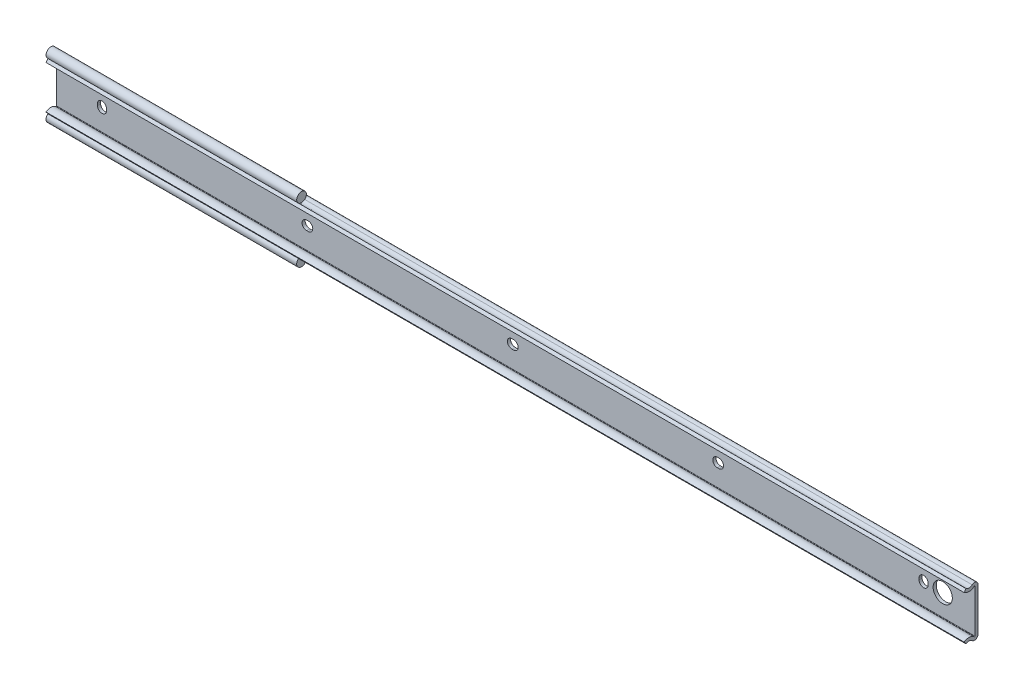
ISO-10303-21;
HEADER;
FILE_DESCRIPTION(('STEP AP214'),'2;1');
FILE_NAME('part.step','',(''),(''),'','','');
FILE_SCHEMA(('AUTOMOTIVE_DESIGN { 1 0 10303 214 1 1 1 1 }'));
ENDSEC;
DATA;
#1=APPLICATION_CONTEXT('core data for automotive mechanical design processes');
#2=APPLICATION_PROTOCOL_DEFINITION('international standard','automotive_design',2000,#1);
#3=PRODUCT_CONTEXT('',#1,'mechanical');
#4=PRODUCT('Part','Part','',(#3));
#5=PRODUCT_RELATED_PRODUCT_CATEGORY('part','',(#4));
#6=PRODUCT_DEFINITION_FORMATION('','',#4);
#7=PRODUCT_DEFINITION_CONTEXT('part definition',#1,'design');
#8=PRODUCT_DEFINITION('design','',#6,#7);
#9=PRODUCT_DEFINITION_SHAPE('','',#8);
#10=(LENGTH_UNIT() NAMED_UNIT(*) SI_UNIT(.MILLI.,.METRE.));
#11=(NAMED_UNIT(*) PLANE_ANGLE_UNIT() SI_UNIT($,.RADIAN.));
#12=(NAMED_UNIT(*) SI_UNIT($,.STERADIAN.) SOLID_ANGLE_UNIT());
#13=UNCERTAINTY_MEASURE_WITH_UNIT(LENGTH_MEASURE(1.E-05),#10,'distance_accuracy_value','');
#14=(GEOMETRIC_REPRESENTATION_CONTEXT(3) GLOBAL_UNCERTAINTY_ASSIGNED_CONTEXT((#13)) GLOBAL_UNIT_ASSIGNED_CONTEXT((#10,
#11,#12)) REPRESENTATION_CONTEXT('',''));
#15=CARTESIAN_POINT('',(0.,0.,0.));
#16=DIRECTION('',(0.,0.,1.));
#17=DIRECTION('',(1.,0.,0.));
#18=AXIS2_PLACEMENT_3D('',#15,#16,#17);
#19=CARTESIAN_POINT('',(431.8,10.6847650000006,1.74000019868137));
#20=DIRECTION('',(-1.,0.,0.));
#21=DIRECTION('',(0.,0.,1.));
#22=AXIS2_PLACEMENT_3D('',#19,#20,#21);
#23=CYLINDRICAL_SURFACE('',#22,1.7400001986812);
#24=CARTESIAN_POINT('',(-22.4,10.6847650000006,1.74000019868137));
#25=DIRECTION('',(1.,0.,0.));
#26=DIRECTION('',(0.,0.,-1.));
#27=AXIS2_PLACEMENT_3D('',#24,#25,#26);
#28=CIRCLE('',#27,1.7400001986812);
#29=CARTESIAN_POINT('',(-22.4,12.421670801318,1.84372545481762));
#30=VERTEX_POINT('',#29);
#31=CARTESIAN_POINT('',(-22.4,12.1726708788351,2.64207380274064));
#32=VERTEX_POINT('',#31);
#33=EDGE_CURVE('E277',#30,#32,#28,.T.);
#34=ORIENTED_EDGE('',*,*,#33,.T.);
#35=DIRECTION('',(-1.,0.,0.));
#36=VECTOR('',#35,1.);
#37=CARTESIAN_POINT('',(39.6,12.1726708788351,2.64207380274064));
#38=LINE('',#37,#36);
#39=CARTESIAN_POINT('',(101.6,12.1726708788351,2.64207380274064));
#40=VERTEX_POINT('',#39);
#41=EDGE_CURVE('E494',#32,#40,#38,.F.);
#42=ORIENTED_EDGE('',*,*,#41,.T.);
#43=CARTESIAN_POINT('',(101.6,10.6847650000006,1.74000019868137));
#44=DIRECTION('',(-1.,0.,0.));
#45=DIRECTION('',(0.,0.,1.));
#46=AXIS2_PLACEMENT_3D('',#43,#44,#45);
#47=CIRCLE('',#46,1.7400001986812);
#48=CARTESIAN_POINT('',(101.6,11.9768810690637,2.90534853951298));
#49=VERTEX_POINT('',#48);
#50=EDGE_CURVE('E490',#49,#40,#47,.T.);
#51=ORIENTED_EDGE('',*,*,#50,.F.);
#52=DIRECTION('',(-1.,0.,0.));
#53=VECTOR('',#52,1.);
#54=CARTESIAN_POINT('',(431.8,11.9768810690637,2.90534853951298));
#55=LINE('',#54,#53);
#56=CARTESIAN_POINT('',(431.8,11.9768810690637,2.90534853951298));
#57=VERTEX_POINT('',#56);
#58=EDGE_CURVE('E367',#57,#49,#55,.T.);
#59=ORIENTED_EDGE('',*,*,#58,.F.);
#60=CARTESIAN_POINT('',(431.8,10.6847650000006,1.74000019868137));
#61=DIRECTION('',(1.,0.,0.));
#62=DIRECTION('',(0.,0.,-1.));
#63=AXIS2_PLACEMENT_3D('',#60,#61,#62);
#64=CIRCLE('',#63,1.7400001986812);
#65=CARTESIAN_POINT('',(431.8,12.421670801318,1.84372545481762));
#66=VERTEX_POINT('',#65);
#67=EDGE_CURVE('E274',#66,#57,#64,.T.);
#68=ORIENTED_EDGE('',*,*,#67,.F.);
#69=CARTESIAN_POINT('',(431.8,10.6847650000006,1.74000019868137));
#70=DIRECTION('',(-1.,0.,0.));
#71=DIRECTION('',(0.,0.998221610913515,0.0596122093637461));
#72=AXIS2_PLACEMENT_3D('',#69,#70,#71);
#73=CIRCLE('',#72,1.7400001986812);
#74=CARTESIAN_POINT('',(431.8,12.421670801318,1.63627494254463));
#75=VERTEX_POINT('',#74);
#76=EDGE_CURVE('E265',#66,#75,#73,.T.);
#77=ORIENTED_EDGE('',*,*,#76,.T.);
#78=CARTESIAN_POINT('',(431.8,10.6847650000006,0.));
#79=VERTEX_POINT('',#78);
#80=EDGE_CURVE('E262',#79,#75,#64,.T.);
#81=ORIENTED_EDGE('',*,*,#80,.F.);
#82=DIRECTION('',(-1.,0.,0.));
#83=VECTOR('',#82,1.);
#84=CARTESIAN_POINT('',(431.8,10.6847650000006,0.));
#85=LINE('',#84,#83);
#86=CARTESIAN_POINT('',(-22.4,10.6847650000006,0.));
#87=VERTEX_POINT('',#86);
#88=EDGE_CURVE('E399',#79,#87,#85,.T.);
#89=ORIENTED_EDGE('',*,*,#88,.T.);
#90=CARTESIAN_POINT('',(-22.4,12.421670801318,1.63627494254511));
#91=VERTEX_POINT('',#90);
#92=EDGE_CURVE('E294',#87,#91,#28,.T.);
#93=ORIENTED_EDGE('',*,*,#92,.T.);
#94=CARTESIAN_POINT('',(-22.4,10.6847650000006,1.74000019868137));
#95=DIRECTION('',(1.,0.,0.));
#96=DIRECTION('',(0.,0.998221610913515,-0.0596122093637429));
#97=AXIS2_PLACEMENT_3D('',#94,#95,#96);
#98=CIRCLE('',#97,1.7400001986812);
#99=EDGE_CURVE('E291',#91,#30,#98,.T.);
#100=ORIENTED_EDGE('',*,*,#99,.T.);
#101=EDGE_LOOP('',(#34,#42,#51,#59,#68,#77,#81,#89,#93,#100));
#102=FACE_BOUND('',#101,.T.);
#103=ADVANCED_FACE('F16',(#102),#23,.T.);
#104=CARTESIAN_POINT('',(431.8,10.6847650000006,1.74000019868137));
#105=DIRECTION('',(1.,0.,0.));
#106=DIRECTION('',(0.,0.,-1.));
#107=AXIS2_PLACEMENT_3D('',#104,#105,#106);
#108=PLANE('',#107);
#109=DIRECTION('',(0.,1.,0.));
#110=VECTOR('',#109,1.);
#111=CARTESIAN_POINT('',(431.8,-10.6847650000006,0.));
#112=LINE('',#111,#110);
#113=CARTESIAN_POINT('',(431.8,-10.6847650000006,0.));
#114=VERTEX_POINT('',#113);
#115=EDGE_CURVE('E269',#114,#79,#112,.T.);
#116=ORIENTED_EDGE('',*,*,#115,.T.);
#117=ORIENTED_EDGE('',*,*,#80,.T.);
#118=ORIENTED_EDGE('',*,*,#76,.F.);
#119=ORIENTED_EDGE('',*,*,#67,.T.);
#120=CARTESIAN_POINT('',(431.8,13.7450000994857,4.50000028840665));
#121=DIRECTION('',(-1.,0.,0.));
#122=DIRECTION('',(0.,0.,-1.));
#123=AXIS2_PLACEMENT_3D('',#120,#121,#122);
#124=CIRCLE('',#123,2.38099960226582);
#125=CARTESIAN_POINT('',(431.8,11.8434490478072,5.93292132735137));
#126=VERTEX_POINT('',#125);
#127=EDGE_CURVE('E273',#57,#126,#124,.T.);
#128=ORIENTED_EDGE('',*,*,#127,.T.);
#129=DIRECTION('',(0.,-0.798635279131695,0.601815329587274));
#130=VECTOR('',#129,1.);
#131=CARTESIAN_POINT('',(431.8,10.6055642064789,6.86573520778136));
#132=LINE('',#131,#130);
#133=CARTESIAN_POINT('',(431.8,10.6055642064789,6.86573520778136));
#134=VERTEX_POINT('',#133);
#135=EDGE_CURVE('E417',#126,#134,#132,.T.);
#136=ORIENTED_EDGE('',*,*,#135,.T.);
#137=CARTESIAN_POINT('',(431.8,13.7450000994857,4.50000028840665));
#138=DIRECTION('',(1.,0.,0.));
#139=DIRECTION('',(0.,0.,-1.));
#140=AXIS2_PLACEMENT_3D('',#137,#138,#139);
#141=CIRCLE('',#140,3.9309998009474);
#142=CARTESIAN_POINT('',(431.8,10.8258581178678,1.86725086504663));
#143=VERTEX_POINT('',#142);
#144=EDGE_CURVE('E416',#134,#143,#141,.T.);
#145=ORIENTED_EDGE('',*,*,#144,.T.);
#146=CARTESIAN_POINT('',(431.8,10.6847650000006,1.74000019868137));
#147=DIRECTION('',(-1.,0.,0.));
#148=DIRECTION('',(0.,0.,-1.));
#149=AXIS2_PLACEMENT_3D('',#146,#147,#148);
#150=CIRCLE('',#149,0.18999999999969);
#151=CARTESIAN_POINT('',(431.8,10.6847650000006,1.55000019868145));
#152=VERTEX_POINT('',#151);
#153=EDGE_CURVE('E414',#143,#152,#150,.T.);
#154=ORIENTED_EDGE('',*,*,#153,.T.);
#155=DIRECTION('',(0.,-1.,0.));
#156=VECTOR('',#155,1.);
#157=CARTESIAN_POINT('',(431.8,-10.6847650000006,1.55000019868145));
#158=LINE('',#157,#156);
#159=CARTESIAN_POINT('',(431.8,-10.6847650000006,1.55000019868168));
#160=VERTEX_POINT('',#159);
#161=EDGE_CURVE('E412',#152,#160,#158,.T.);
#162=ORIENTED_EDGE('',*,*,#161,.T.);
#163=CARTESIAN_POINT('',(431.8,-10.6847650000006,1.74000019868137));
#164=DIRECTION('',(-1.,0.,0.));
#165=DIRECTION('',(0.,0.,1.));
#166=AXIS2_PLACEMENT_3D('',#163,#164,#165);
#167=CIRCLE('',#166,0.18999999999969);
#168=CARTESIAN_POINT('',(431.8,-10.8258581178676,1.86725086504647));
#169=VERTEX_POINT('',#168);
#170=EDGE_CURVE('E410',#160,#169,#167,.T.);
#171=ORIENTED_EDGE('',*,*,#170,.T.);
#172=CARTESIAN_POINT('',(431.8,-13.7450000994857,4.50000028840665));
#173=DIRECTION('',(1.,0.,0.));
#174=DIRECTION('',(0.,0.,1.));
#175=AXIS2_PLACEMENT_3D('',#172,#173,#174);
#176=CIRCLE('',#175,3.9309998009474);
#177=CARTESIAN_POINT('',(431.8,-10.6055642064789,6.86573520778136));
#178=VERTEX_POINT('',#177);
#179=EDGE_CURVE('E408',#169,#178,#176,.T.);
#180=ORIENTED_EDGE('',*,*,#179,.T.);
#181=DIRECTION('',(0.,-0.798635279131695,-0.601815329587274));
#182=VECTOR('',#181,1.);
#183=CARTESIAN_POINT('',(431.8,-10.6055642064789,6.86573520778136));
#184=LINE('',#183,#182);
#185=CARTESIAN_POINT('',(431.8,-11.8434490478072,5.93292132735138));
#186=VERTEX_POINT('',#185);
#187=EDGE_CURVE('E406',#178,#186,#184,.T.);
#188=ORIENTED_EDGE('',*,*,#187,.T.);
#189=CARTESIAN_POINT('',(431.8,-13.7450000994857,4.50000028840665));
#190=DIRECTION('',(-1.,0.,0.));
#191=DIRECTION('',(0.,0.,1.));
#192=AXIS2_PLACEMENT_3D('',#189,#190,#191);
#193=CIRCLE('',#192,2.38099960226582);
#194=CARTESIAN_POINT('',(431.8,-11.9768810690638,2.90534853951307));
#195=VERTEX_POINT('',#194);
#196=EDGE_CURVE('E404',#186,#195,#193,.T.);
#197=ORIENTED_EDGE('',*,*,#196,.T.);
#198=CARTESIAN_POINT('',(431.8,-10.6847650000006,1.74000019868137));
#199=DIRECTION('',(1.,0.,0.));
#200=DIRECTION('',(0.,0.,1.));
#201=AXIS2_PLACEMENT_3D('',#198,#199,#200);
#202=CIRCLE('',#201,1.7400001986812);
#203=EDGE_CURVE('E402',#195,#114,#202,.T.);
#204=ORIENTED_EDGE('',*,*,#203,.T.);
#205=EDGE_LOOP('',(#116,#117,#118,#119,#128,#136,#145,#154,#162,#171,#180,#188,#197,#204));
#206=FACE_BOUND('',#205,.T.);
#207=ADVANCED_FACE('F264',(#206),#108,.T.);
#208=CARTESIAN_POINT('',(-22.4,10.6847650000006,1.74000019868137));
#209=DIRECTION('',(1.,0.,0.));
#210=DIRECTION('',(0.,0.,-1.));
#211=AXIS2_PLACEMENT_3D('',#208,#209,#210);
#212=PLANE('',#211);
#213=CARTESIAN_POINT('',(-22.4,13.745,4.45));
#214=DIRECTION('',(-1.,0.,0.));
#215=DIRECTION('',(0.,0.,1.));
#216=AXIS2_PLACEMENT_3D('',#213,#214,#215);
#217=CIRCLE('',#216,2.396);
#218=CARTESIAN_POINT('',(-22.3999999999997,11.4666473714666,5.19156948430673));
#219=VERTEX_POINT('',#218);
#220=EDGE_CURVE('E486',#219,#32,#217,.T.);
#221=ORIENTED_EDGE('',*,*,#220,.T.);
#222=ORIENTED_EDGE('',*,*,#33,.F.);
#223=ORIENTED_EDGE('',*,*,#99,.F.);
#224=ORIENTED_EDGE('',*,*,#92,.F.);
#225=DIRECTION('',(0.,1.,0.));
#226=VECTOR('',#225,1.);
#227=CARTESIAN_POINT('',(-22.4,-10.6847650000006,0.));
#228=LINE('',#227,#226);
#229=CARTESIAN_POINT('',(-22.4,-10.6847650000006,0.));
#230=VERTEX_POINT('',#229);
#231=EDGE_CURVE('E320',#230,#87,#228,.T.);
#232=ORIENTED_EDGE('',*,*,#231,.F.);
#233=CARTESIAN_POINT('',(-22.4,-10.6847650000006,1.74000019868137));
#234=DIRECTION('',(1.,0.,0.));
#235=DIRECTION('',(0.,0.,1.));
#236=AXIS2_PLACEMENT_3D('',#233,#234,#235);
#237=CIRCLE('',#236,1.7400001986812);
#238=CARTESIAN_POINT('',(-22.4,-12.1726708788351,2.64207380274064));
#239=VERTEX_POINT('',#238);
#240=EDGE_CURVE('E318',#239,#230,#237,.T.);
#241=ORIENTED_EDGE('',*,*,#240,.F.);
#242=CARTESIAN_POINT('',(-22.4,-13.745,4.45));
#243=DIRECTION('',(-1.,0.,0.));
#244=DIRECTION('',(0.,0.,-1.));
#245=AXIS2_PLACEMENT_3D('',#242,#243,#244);
#246=CIRCLE('',#245,2.396);
#247=CARTESIAN_POINT('',(-22.4,-11.4666473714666,5.19156948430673));
#248=VERTEX_POINT('',#247);
#249=EDGE_CURVE('E468',#239,#248,#246,.T.);
#250=ORIENTED_EDGE('',*,*,#249,.T.);
#251=CARTESIAN_POINT('',(-22.4,-13.7450000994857,4.50000028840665));
#252=DIRECTION('',(-1.,0.,0.));
#253=DIRECTION('',(0.,0.,1.));
#254=AXIS2_PLACEMENT_3D('',#251,#252,#253);
#255=CIRCLE('',#254,2.38099960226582);
#256=CARTESIAN_POINT('',(-22.4,-11.8434490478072,5.93292132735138));
#257=VERTEX_POINT('',#256);
#258=EDGE_CURVE('E39',#257,#248,#255,.T.);
#259=ORIENTED_EDGE('',*,*,#258,.F.);
#260=DIRECTION('',(0.,-0.798635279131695,-0.601815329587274));
#261=VECTOR('',#260,1.);
#262=CARTESIAN_POINT('',(-22.4,-10.6055642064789,6.86573520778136));
#263=LINE('',#262,#261);
#264=CARTESIAN_POINT('',(-22.4,-10.6055642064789,6.86573520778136));
#265=VERTEX_POINT('',#264);
#266=EDGE_CURVE('E315',#265,#257,#263,.T.);
#267=ORIENTED_EDGE('',*,*,#266,.F.);
#268=CARTESIAN_POINT('',(-22.4,-13.7450000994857,4.50000028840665));
#269=DIRECTION('',(1.,0.,0.));
#270=DIRECTION('',(0.,0.,1.));
#271=AXIS2_PLACEMENT_3D('',#268,#269,#270);
#272=CIRCLE('',#271,3.9309998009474);
#273=CARTESIAN_POINT('',(-22.4,-10.8258581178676,1.86725086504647));
#274=VERTEX_POINT('',#273);
#275=EDGE_CURVE('E313',#274,#265,#272,.T.);
#276=ORIENTED_EDGE('',*,*,#275,.F.);
#277=CARTESIAN_POINT('',(-22.4,-10.6847650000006,1.74000019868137));
#278=DIRECTION('',(-1.,0.,0.));
#279=DIRECTION('',(0.,0.,1.));
#280=AXIS2_PLACEMENT_3D('',#277,#278,#279);
#281=CIRCLE('',#280,0.18999999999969);
#282=CARTESIAN_POINT('',(-22.4,-10.6847650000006,1.55000019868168));
#283=VERTEX_POINT('',#282);
#284=EDGE_CURVE('E311',#283,#274,#281,.T.);
#285=ORIENTED_EDGE('',*,*,#284,.F.);
#286=DIRECTION('',(0.,-1.,0.));
#287=VECTOR('',#286,1.);
#288=CARTESIAN_POINT('',(-22.4,-10.6847650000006,1.55000019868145));
#289=LINE('',#288,#287);
#290=CARTESIAN_POINT('',(-22.4,10.6847650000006,1.55000019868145));
#291=VERTEX_POINT('',#290);
#292=EDGE_CURVE('E309',#291,#283,#289,.T.);
#293=ORIENTED_EDGE('',*,*,#292,.F.);
#294=CARTESIAN_POINT('',(-22.4,10.6847650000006,1.74000019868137));
#295=DIRECTION('',(-1.,0.,0.));
#296=DIRECTION('',(0.,0.,-1.));
#297=AXIS2_PLACEMENT_3D('',#294,#295,#296);
#298=CIRCLE('',#297,0.18999999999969);
#299=CARTESIAN_POINT('',(-22.4,10.8258581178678,1.86725086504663));
#300=VERTEX_POINT('',#299);
#301=EDGE_CURVE('E307',#300,#291,#298,.T.);
#302=ORIENTED_EDGE('',*,*,#301,.F.);
#303=CARTESIAN_POINT('',(-22.4,13.7450000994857,4.50000028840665));
#304=DIRECTION('',(1.,0.,0.));
#305=DIRECTION('',(0.,0.,-1.));
#306=AXIS2_PLACEMENT_3D('',#303,#304,#305);
#307=CIRCLE('',#306,3.9309998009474);
#308=CARTESIAN_POINT('',(-22.4,10.6055642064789,6.86573520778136));
#309=VERTEX_POINT('',#308);
#310=EDGE_CURVE('E305',#309,#300,#307,.T.);
#311=ORIENTED_EDGE('',*,*,#310,.F.);
#312=DIRECTION('',(0.,-0.798635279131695,0.601815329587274));
#313=VECTOR('',#312,1.);
#314=CARTESIAN_POINT('',(-22.4,10.6055642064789,6.86573520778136));
#315=LINE('',#314,#313);
#316=CARTESIAN_POINT('',(-22.4,11.8434490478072,5.93292132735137));
#317=VERTEX_POINT('',#316);
#318=EDGE_CURVE('E303',#317,#309,#315,.T.);
#319=ORIENTED_EDGE('',*,*,#318,.F.);
#320=CARTESIAN_POINT('',(-22.4,13.7450000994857,4.50000028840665));
#321=DIRECTION('',(-1.,0.,0.));
#322=DIRECTION('',(0.,0.,-1.));
#323=AXIS2_PLACEMENT_3D('',#320,#321,#322);
#324=CIRCLE('',#323,2.38099960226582);
#325=EDGE_CURVE('E300',#219,#317,#324,.T.);
#326=ORIENTED_EDGE('',*,*,#325,.F.);
#327=EDGE_LOOP('',(#221,#222,#223,#224,#232,#241,#250,#259,#267,#276,#285,#293,#302,#311,#319,#326));
#328=FACE_BOUND('',#327,.T.);
#329=ADVANCED_FACE('F334',(#328),#212,.F.);
#330=CARTESIAN_POINT('',(431.8,13.7450000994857,4.50000028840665));
#331=DIRECTION('',(-1.,0.,0.));
#332=DIRECTION('',(0.,0.,1.));
#333=AXIS2_PLACEMENT_3D('',#330,#331,#332);
#334=CYLINDRICAL_SURFACE('',#333,2.38099960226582);
#335=CARTESIAN_POINT('',(101.6,13.7450000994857,4.50000028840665));
#336=DIRECTION('',(-1.,0.,0.));
#337=DIRECTION('',(0.,0.,1.));
#338=AXIS2_PLACEMENT_3D('',#335,#336,#337);
#339=CIRCLE('',#338,2.38099960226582);
#340=CARTESIAN_POINT('',(101.6,11.4666473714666,5.19156948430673));
#341=VERTEX_POINT('',#340);
#342=EDGE_CURVE('E364',#341,#49,#339,.F.);
#343=ORIENTED_EDGE('',*,*,#342,.F.);
#344=DIRECTION('',(-1.,0.,0.));
#345=VECTOR('',#344,1.);
#346=CARTESIAN_POINT('',(39.6,11.4666473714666,5.19156948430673));
#347=LINE('',#346,#345);
#348=EDGE_CURVE('E361',#341,#219,#347,.T.);
#349=ORIENTED_EDGE('',*,*,#348,.T.);
#350=ORIENTED_EDGE('',*,*,#325,.T.);
#351=DIRECTION('',(-1.,0.,0.));
#352=VECTOR('',#351,1.);
#353=CARTESIAN_POINT('',(431.8,11.8434490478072,5.93292132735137));
#354=LINE('',#353,#352);
#355=EDGE_CURVE('E370',#126,#317,#354,.T.);
#356=ORIENTED_EDGE('',*,*,#355,.F.);
#357=ORIENTED_EDGE('',*,*,#127,.F.);
#358=ORIENTED_EDGE('',*,*,#58,.T.);
#359=EDGE_LOOP('',(#343,#349,#350,#356,#357,#358));
#360=FACE_BOUND('',#359,.T.);
#361=ADVANCED_FACE('F344',(#360),#334,.F.);
#362=CARTESIAN_POINT('',(431.8,10.6055642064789,6.86573520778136));
#363=DIRECTION('',(0.,-0.601815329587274,-0.798635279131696));
#364=DIRECTION('',(0.,0.798635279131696,-0.601815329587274));
#365=AXIS2_PLACEMENT_3D('',#362,#363,#364);
#366=PLANE('',#365);
#367=ORIENTED_EDGE('',*,*,#318,.T.);
#368=DIRECTION('',(-1.,0.,0.));
#369=VECTOR('',#368,1.);
#370=CARTESIAN_POINT('',(431.8,10.6055642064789,6.86573520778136));
#371=LINE('',#370,#369);
#372=EDGE_CURVE('E373',#134,#309,#371,.T.);
#373=ORIENTED_EDGE('',*,*,#372,.F.);
#374=ORIENTED_EDGE('',*,*,#135,.F.);
#375=ORIENTED_EDGE('',*,*,#355,.T.);
#376=EDGE_LOOP('',(#367,#373,#374,#375));
#377=FACE_BOUND('',#376,.T.);
#378=ADVANCED_FACE('F425',(#377),#366,.F.);
#379=CARTESIAN_POINT('',(431.8,13.7450000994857,4.50000028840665));
#380=DIRECTION('',(-1.,0.,0.));
#381=DIRECTION('',(0.,0.,1.));
#382=AXIS2_PLACEMENT_3D('',#379,#380,#381);
#383=CYLINDRICAL_SURFACE('',#382,3.9309998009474);
#384=ORIENTED_EDGE('',*,*,#310,.T.);
#385=DIRECTION('',(-1.,0.,0.));
#386=VECTOR('',#385,1.);
#387=CARTESIAN_POINT('',(431.8,10.8258581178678,1.86725086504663));
#388=LINE('',#387,#386);
#389=EDGE_CURVE('E376',#143,#300,#388,.T.);
#390=ORIENTED_EDGE('',*,*,#389,.F.);
#391=ORIENTED_EDGE('',*,*,#144,.F.);
#392=ORIENTED_EDGE('',*,*,#372,.T.);
#393=EDGE_LOOP('',(#384,#390,#391,#392));
#394=FACE_BOUND('',#393,.T.);
#395=ADVANCED_FACE('F430',(#394),#383,.T.);
#396=CARTESIAN_POINT('',(431.8,10.6847650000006,1.74000019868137));
#397=DIRECTION('',(-1.,0.,0.));
#398=DIRECTION('',(0.,0.,1.));
#399=AXIS2_PLACEMENT_3D('',#396,#397,#398);
#400=CYLINDRICAL_SURFACE('',#399,0.18999999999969);
#401=ORIENTED_EDGE('',*,*,#301,.T.);
#402=DIRECTION('',(-1.,0.,0.));
#403=VECTOR('',#402,1.);
#404=CARTESIAN_POINT('',(431.8,10.6847650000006,1.55000019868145));
#405=LINE('',#404,#403);
#406=EDGE_CURVE('E379',#152,#291,#405,.T.);
#407=ORIENTED_EDGE('',*,*,#406,.F.);
#408=ORIENTED_EDGE('',*,*,#153,.F.);
#409=ORIENTED_EDGE('',*,*,#389,.T.);
#410=EDGE_LOOP('',(#401,#407,#408,#409));
#411=FACE_BOUND('',#410,.T.);
#412=ADVANCED_FACE('F436',(#411),#400,.F.);
#413=CARTESIAN_POINT('',(431.8,-10.6847650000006,1.55000019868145));
#414=DIRECTION('',(0.,0.,-1.));
#415=DIRECTION('',(-1.,0.,0.));
#416=AXIS2_PLACEMENT_3D('',#413,#414,#415);
#417=PLANE('',#416);
#418=CARTESIAN_POINT('',(415.9,0.,1.55000019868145));
#419=DIRECTION('',(0.,0.,-1.));
#420=DIRECTION('',(-1.,0.,0.));
#421=AXIS2_PLACEMENT_3D('',#418,#419,#420);
#422=CIRCLE('',#421,4.75);
#423=CARTESIAN_POINT('',(411.15,0.,1.55000019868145));
#424=VERTEX_POINT('',#423);
#425=EDGE_CURVE('E476',#424,#424,#422,.T.);
#426=ORIENTED_EDGE('',*,*,#425,.T.);
#427=EDGE_LOOP('',(#426));
#428=FACE_BOUND('',#427,.T.);
#429=DIRECTION('',(-1.,0.,0.));
#430=VECTOR('',#429,1.);
#431=CARTESIAN_POINT('',(102.00000000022,2.24999999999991,1.55000019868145));
#432=LINE('',#431,#430);
#433=CARTESIAN_POINT('',(102.00000000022,2.24999999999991,1.55000019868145));
#434=VERTEX_POINT('',#433);
#435=CARTESIAN_POINT('',(101.20000000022,2.24999999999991,1.55000019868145));
#436=VERTEX_POINT('',#435);
#437=EDGE_CURVE('E498',#434,#436,#432,.T.);
#438=ORIENTED_EDGE('',*,*,#437,.F.);
#439=CARTESIAN_POINT('',(102.00000000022,0.,1.55000019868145));
#440=DIRECTION('',(0.,0.,-1.));
#441=DIRECTION('',(-1.,0.,0.));
#442=AXIS2_PLACEMENT_3D('',#439,#440,#441);
#443=CIRCLE('',#442,2.24999999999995);
#444=CARTESIAN_POINT('',(102.00000000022,-2.25,1.55000019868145));
#445=VERTEX_POINT('',#444);
#446=EDGE_CURVE('E501',#445,#434,#443,.F.);
#447=ORIENTED_EDGE('',*,*,#446,.F.);
#448=DIRECTION('',(1.,0.,0.));
#449=VECTOR('',#448,1.);
#450=CARTESIAN_POINT('',(102.00000000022,-2.25,1.55000019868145));
#451=LINE('',#450,#449);
#452=CARTESIAN_POINT('',(101.20000000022,-2.25,1.55000019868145));
#453=VERTEX_POINT('',#452);
#454=EDGE_CURVE('E518',#453,#445,#451,.T.);
#455=ORIENTED_EDGE('',*,*,#454,.F.);
#456=CARTESIAN_POINT('',(101.20000000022,0.,1.55000019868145));
#457=DIRECTION('',(0.,0.,-1.));
#458=DIRECTION('',(-1.,0.,0.));
#459=AXIS2_PLACEMENT_3D('',#456,#457,#458);
#460=CIRCLE('',#459,2.24999999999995);
#461=EDGE_CURVE('E496',#436,#453,#460,.F.);
#462=ORIENTED_EDGE('',*,*,#461,.F.);
#463=EDGE_LOOP('',(#438,#447,#455,#462));
#464=FACE_BOUND('',#463,.T.);
#465=DIRECTION('',(-1.,0.,0.));
#466=VECTOR('',#465,1.);
#467=CARTESIAN_POINT('',(203.6,2.24999999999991,1.55000019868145));
#468=LINE('',#467,#466);
#469=CARTESIAN_POINT('',(203.6,2.24999999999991,1.55000019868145));
#470=VERTEX_POINT('',#469);
#471=CARTESIAN_POINT('',(202.8,2.24999999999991,1.55000019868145));
#472=VERTEX_POINT('',#471);
#473=EDGE_CURVE('E529',#470,#472,#468,.T.);
#474=ORIENTED_EDGE('',*,*,#473,.F.);
#475=CARTESIAN_POINT('',(203.6,0.,1.55000019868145));
#476=DIRECTION('',(0.,0.,-1.));
#477=DIRECTION('',(-1.,0.,0.));
#478=AXIS2_PLACEMENT_3D('',#475,#476,#477);
#479=CIRCLE('',#478,2.24999999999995);
#480=CARTESIAN_POINT('',(203.6,-2.25,1.55000019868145));
#481=VERTEX_POINT('',#480);
#482=EDGE_CURVE('E532',#481,#470,#479,.F.);
#483=ORIENTED_EDGE('',*,*,#482,.F.);
#484=DIRECTION('',(1.,0.,0.));
#485=VECTOR('',#484,1.);
#486=CARTESIAN_POINT('',(203.6,-2.25,1.55000019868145));
#487=LINE('',#486,#485);
#488=CARTESIAN_POINT('',(202.8,-2.25,1.55000019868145));
#489=VERTEX_POINT('',#488);
#490=EDGE_CURVE('E549',#489,#481,#487,.T.);
#491=ORIENTED_EDGE('',*,*,#490,.F.);
#492=CARTESIAN_POINT('',(202.8,0.,1.55000019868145));
#493=DIRECTION('',(0.,0.,-1.));
#494=DIRECTION('',(-1.,0.,0.));
#495=AXIS2_PLACEMENT_3D('',#492,#493,#494);
#496=CIRCLE('',#495,2.24999999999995);
#497=EDGE_CURVE('E527',#472,#489,#496,.F.);
#498=ORIENTED_EDGE('',*,*,#497,.F.);
#499=EDGE_LOOP('',(#474,#483,#491,#498));
#500=FACE_BOUND('',#499,.T.);
#501=DIRECTION('',(0.,-1.,0.));
#502=VECTOR('',#501,1.);
#503=CARTESIAN_POINT('',(-2.25,0.4,1.55000019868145));
#504=LINE('',#503,#502);
#505=CARTESIAN_POINT('',(-2.25,0.4,1.55000019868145));
#506=VERTEX_POINT('',#505);
#507=CARTESIAN_POINT('',(-2.25,-0.4,1.55000019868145));
#508=VERTEX_POINT('',#507);
#509=EDGE_CURVE('E560',#506,#508,#504,.T.);
#510=ORIENTED_EDGE('',*,*,#509,.F.);
#511=CARTESIAN_POINT('',(0.,0.4,1.55000019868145));
#512=DIRECTION('',(0.,0.,-1.));
#513=DIRECTION('',(-1.,0.,0.));
#514=AXIS2_PLACEMENT_3D('',#511,#512,#513);
#515=CIRCLE('',#514,2.24999999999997);
#516=CARTESIAN_POINT('',(2.25,0.4,1.55000019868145));
#517=VERTEX_POINT('',#516);
#518=EDGE_CURVE('E563',#517,#506,#515,.F.);
#519=ORIENTED_EDGE('',*,*,#518,.F.);
#520=DIRECTION('',(0.,1.,0.));
#521=VECTOR('',#520,1.);
#522=CARTESIAN_POINT('',(2.25,0.4,1.55000019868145));
#523=LINE('',#522,#521);
#524=CARTESIAN_POINT('',(2.25,-0.4,1.55000019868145));
#525=VERTEX_POINT('',#524);
#526=EDGE_CURVE('E580',#525,#517,#523,.T.);
#527=ORIENTED_EDGE('',*,*,#526,.F.);
#528=CARTESIAN_POINT('',(0.,-0.4,1.55000019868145));
#529=DIRECTION('',(0.,0.,-1.));
#530=DIRECTION('',(-1.,0.,0.));
#531=AXIS2_PLACEMENT_3D('',#528,#529,#530);
#532=CIRCLE('',#531,2.24999999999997);
#533=EDGE_CURVE('E558',#508,#525,#532,.F.);
#534=ORIENTED_EDGE('',*,*,#533,.F.);
#535=EDGE_LOOP('',(#510,#519,#527,#534));
#536=FACE_BOUND('',#535,.T.);
#537=DIRECTION('',(0.,-1.,0.));
#538=VECTOR('',#537,1.);
#539=CARTESIAN_POINT('',(404.15,0.4,1.55000019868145));
#540=LINE('',#539,#538);
#541=CARTESIAN_POINT('',(404.15,0.4,1.55000019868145));
#542=VERTEX_POINT('',#541);
#543=CARTESIAN_POINT('',(404.15,-0.4,1.55000019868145));
#544=VERTEX_POINT('',#543);
#545=EDGE_CURVE('E591',#542,#544,#540,.T.);
#546=ORIENTED_EDGE('',*,*,#545,.F.);
#547=CARTESIAN_POINT('',(406.4,0.4,1.55000019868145));
#548=DIRECTION('',(0.,0.,-1.));
#549=DIRECTION('',(-1.,0.,0.));
#550=AXIS2_PLACEMENT_3D('',#547,#548,#549);
#551=CIRCLE('',#550,2.24999999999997);
#552=CARTESIAN_POINT('',(408.65,0.4,1.55000019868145));
#553=VERTEX_POINT('',#552);
#554=EDGE_CURVE('E594',#553,#542,#551,.F.);
#555=ORIENTED_EDGE('',*,*,#554,.F.);
#556=DIRECTION('',(0.,1.,0.));
#557=VECTOR('',#556,1.);
#558=CARTESIAN_POINT('',(408.65,0.4,1.55000019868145));
#559=LINE('',#558,#557);
#560=CARTESIAN_POINT('',(408.65,-0.4,1.55000019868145));
#561=VERTEX_POINT('',#560);
#562=EDGE_CURVE('E611',#561,#553,#559,.T.);
#563=ORIENTED_EDGE('',*,*,#562,.F.);
#564=CARTESIAN_POINT('',(406.4,-0.4,1.55000019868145));
#565=DIRECTION('',(0.,0.,-1.));
#566=DIRECTION('',(-1.,0.,0.));
#567=AXIS2_PLACEMENT_3D('',#564,#565,#566);
#568=CIRCLE('',#567,2.24999999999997);
#569=EDGE_CURVE('E589',#544,#561,#568,.F.);
#570=ORIENTED_EDGE('',*,*,#569,.F.);
#571=EDGE_LOOP('',(#546,#555,#563,#570));
#572=FACE_BOUND('',#571,.T.);
#573=DIRECTION('',(-1.,0.,0.));
#574=VECTOR('',#573,1.);
#575=CARTESIAN_POINT('',(305.20000000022,2.24999999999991,1.55000019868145));
#576=LINE('',#575,#574);
#577=CARTESIAN_POINT('',(305.20000000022,2.24999999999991,1.55000019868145));
#578=VERTEX_POINT('',#577);
#579=CARTESIAN_POINT('',(304.40000000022,2.24999999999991,1.55000019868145));
#580=VERTEX_POINT('',#579);
#581=EDGE_CURVE('E622',#578,#580,#576,.T.);
#582=ORIENTED_EDGE('',*,*,#581,.F.);
#583=CARTESIAN_POINT('',(305.20000000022,0.,1.55000019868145));
#584=DIRECTION('',(0.,0.,-1.));
#585=DIRECTION('',(-1.,0.,0.));
#586=AXIS2_PLACEMENT_3D('',#583,#584,#585);
#587=CIRCLE('',#586,2.24999999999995);
#588=CARTESIAN_POINT('',(305.20000000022,-2.25,1.55000019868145));
#589=VERTEX_POINT('',#588);
#590=EDGE_CURVE('E625',#589,#578,#587,.F.);
#591=ORIENTED_EDGE('',*,*,#590,.F.);
#592=DIRECTION('',(1.,0.,0.));
#593=VECTOR('',#592,1.);
#594=CARTESIAN_POINT('',(305.20000000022,-2.25,1.55000019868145));
#595=LINE('',#594,#593);
#596=CARTESIAN_POINT('',(304.40000000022,-2.25,1.55000019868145));
#597=VERTEX_POINT('',#596);
#598=EDGE_CURVE('E278',#597,#589,#595,.T.);
#599=ORIENTED_EDGE('',*,*,#598,.F.);
#600=CARTESIAN_POINT('',(304.40000000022,0.,1.55000019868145));
#601=DIRECTION('',(0.,0.,-1.));
#602=DIRECTION('',(-1.,0.,0.));
#603=AXIS2_PLACEMENT_3D('',#600,#601,#602);
#604=CIRCLE('',#603,2.24999999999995);
#605=EDGE_CURVE('E620',#580,#597,#604,.F.);
#606=ORIENTED_EDGE('',*,*,#605,.F.);
#607=EDGE_LOOP('',(#582,#591,#599,#606));
#608=FACE_BOUND('',#607,.T.);
#609=ORIENTED_EDGE('',*,*,#292,.T.);
#610=DIRECTION('',(-1.,0.,0.));
#611=VECTOR('',#610,1.);
#612=CARTESIAN_POINT('',(431.8,-10.6847650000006,1.55000019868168));
#613=LINE('',#612,#611);
#614=EDGE_CURVE('E382',#160,#283,#613,.T.);
#615=ORIENTED_EDGE('',*,*,#614,.F.);
#616=ORIENTED_EDGE('',*,*,#161,.F.);
#617=ORIENTED_EDGE('',*,*,#406,.T.);
#618=EDGE_LOOP('',(#609,#615,#616,#617));
#619=FACE_BOUND('',#618,.T.);
#620=ADVANCED_FACE('F440',(#428,#464,#500,#536,#572,#608,#619),#417,.F.);
#621=CARTESIAN_POINT('',(431.8,-10.6847650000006,1.74000019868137));
#622=DIRECTION('',(-1.,0.,0.));
#623=DIRECTION('',(0.,0.,1.));
#624=AXIS2_PLACEMENT_3D('',#621,#622,#623);
#625=CYLINDRICAL_SURFACE('',#624,0.18999999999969);
#626=ORIENTED_EDGE('',*,*,#284,.T.);
#627=DIRECTION('',(-1.,0.,0.));
#628=VECTOR('',#627,1.);
#629=CARTESIAN_POINT('',(431.8,-10.8258581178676,1.86725086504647));
#630=LINE('',#629,#628);
#631=EDGE_CURVE('E385',#169,#274,#630,.T.);
#632=ORIENTED_EDGE('',*,*,#631,.F.);
#633=ORIENTED_EDGE('',*,*,#170,.F.);
#634=ORIENTED_EDGE('',*,*,#614,.T.);
#635=EDGE_LOOP('',(#626,#632,#633,#634));
#636=FACE_BOUND('',#635,.T.);
#637=ADVANCED_FACE('F445',(#636),#625,.F.);
#638=CARTESIAN_POINT('',(431.8,-13.7450000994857,4.50000028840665));
#639=DIRECTION('',(-1.,0.,0.));
#640=DIRECTION('',(0.,0.,1.));
#641=AXIS2_PLACEMENT_3D('',#638,#639,#640);
#642=CYLINDRICAL_SURFACE('',#641,3.9309998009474);
#643=ORIENTED_EDGE('',*,*,#275,.T.);
#644=DIRECTION('',(-1.,0.,0.));
#645=VECTOR('',#644,1.);
#646=CARTESIAN_POINT('',(431.8,-10.6055642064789,6.86573520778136));
#647=LINE('',#646,#645);
#648=EDGE_CURVE('E388',#178,#265,#647,.T.);
#649=ORIENTED_EDGE('',*,*,#648,.F.);
#650=ORIENTED_EDGE('',*,*,#179,.F.);
#651=ORIENTED_EDGE('',*,*,#631,.T.);
#652=EDGE_LOOP('',(#643,#649,#650,#651));
#653=FACE_BOUND('',#652,.T.);
#654=ADVANCED_FACE('F451',(#653),#642,.T.);
#655=CARTESIAN_POINT('',(431.8,-10.6055642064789,6.86573520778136));
#656=DIRECTION('',(0.,0.601815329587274,-0.798635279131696));
#657=DIRECTION('',(0.,0.798635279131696,0.601815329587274));
#658=AXIS2_PLACEMENT_3D('',#655,#656,#657);
#659=PLANE('',#658);
#660=ORIENTED_EDGE('',*,*,#266,.T.);
#661=DIRECTION('',(-1.,0.,0.));
#662=VECTOR('',#661,1.);
#663=CARTESIAN_POINT('',(431.8,-11.8434490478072,5.93292132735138));
#664=LINE('',#663,#662);
#665=EDGE_CURVE('E391',#186,#257,#664,.T.);
#666=ORIENTED_EDGE('',*,*,#665,.F.);
#667=ORIENTED_EDGE('',*,*,#187,.F.);
#668=ORIENTED_EDGE('',*,*,#648,.T.);
#669=EDGE_LOOP('',(#660,#666,#667,#668));
#670=FACE_BOUND('',#669,.T.);
#671=ADVANCED_FACE('F455',(#670),#659,.F.);
#672=CARTESIAN_POINT('',(431.8,-13.7450000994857,4.50000028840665));
#673=DIRECTION('',(-1.,0.,0.));
#674=DIRECTION('',(0.,0.,1.));
#675=AXIS2_PLACEMENT_3D('',#672,#673,#674);
#676=CYLINDRICAL_SURFACE('',#675,2.38099960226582);
#677=ORIENTED_EDGE('',*,*,#258,.T.);
#678=DIRECTION('',(-1.,0.,0.));
#679=VECTOR('',#678,1.);
#680=CARTESIAN_POINT('',(39.6,-11.4666473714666,5.19156948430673));
#681=LINE('',#680,#679);
#682=CARTESIAN_POINT('',(101.6,-11.4666473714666,5.19156948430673));
#683=VERTEX_POINT('',#682);
#684=EDGE_CURVE('E34',#248,#683,#681,.F.);
#685=ORIENTED_EDGE('',*,*,#684,.T.);
#686=CARTESIAN_POINT('',(101.6,-13.7450000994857,4.50000028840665));
#687=DIRECTION('',(1.,0.,0.));
#688=DIRECTION('',(0.,0.,-1.));
#689=AXIS2_PLACEMENT_3D('',#686,#687,#688);
#690=CIRCLE('',#689,2.38099960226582);
#691=CARTESIAN_POINT('',(101.6,-11.9768810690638,2.90534853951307));
#692=VERTEX_POINT('',#691);
#693=EDGE_CURVE('E478',#683,#692,#690,.F.);
#694=ORIENTED_EDGE('',*,*,#693,.T.);
#695=DIRECTION('',(-1.,0.,0.));
#696=VECTOR('',#695,1.);
#697=CARTESIAN_POINT('',(431.8,-11.9768810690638,2.90534853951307));
#698=LINE('',#697,#696);
#699=EDGE_CURVE('E393',#195,#692,#698,.T.);
#700=ORIENTED_EDGE('',*,*,#699,.F.);
#701=ORIENTED_EDGE('',*,*,#196,.F.);
#702=ORIENTED_EDGE('',*,*,#665,.T.);
#703=EDGE_LOOP('',(#677,#685,#694,#700,#701,#702));
#704=FACE_BOUND('',#703,.T.);
#705=ADVANCED_FACE('F458',(#704),#676,.F.);
#706=CARTESIAN_POINT('',(431.8,-10.6847650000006,1.74000019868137));
#707=DIRECTION('',(-1.,0.,0.));
#708=DIRECTION('',(0.,0.,1.));
#709=AXIS2_PLACEMENT_3D('',#706,#707,#708);
#710=CYLINDRICAL_SURFACE('',#709,1.7400001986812);
#711=CARTESIAN_POINT('',(101.6,-10.6847650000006,1.74000019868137));
#712=DIRECTION('',(1.,0.,0.));
#713=DIRECTION('',(0.,0.,-1.));
#714=AXIS2_PLACEMENT_3D('',#711,#712,#713);
#715=CIRCLE('',#714,1.7400001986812);
#716=CARTESIAN_POINT('',(101.6,-12.1726708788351,2.64207380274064));
#717=VERTEX_POINT('',#716);
#718=EDGE_CURVE('E26',#692,#717,#715,.T.);
#719=ORIENTED_EDGE('',*,*,#718,.T.);
#720=DIRECTION('',(-1.,0.,0.));
#721=VECTOR('',#720,1.);
#722=CARTESIAN_POINT('',(39.6,-12.1726708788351,2.64207380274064));
#723=LINE('',#722,#721);
#724=EDGE_CURVE('E10',#717,#239,#723,.T.);
#725=ORIENTED_EDGE('',*,*,#724,.T.);
#726=ORIENTED_EDGE('',*,*,#240,.T.);
#727=DIRECTION('',(-1.,0.,0.));
#728=VECTOR('',#727,1.);
#729=CARTESIAN_POINT('',(431.8,-10.6847650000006,0.));
#730=LINE('',#729,#728);
#731=EDGE_CURVE('E396',#114,#230,#730,.T.);
#732=ORIENTED_EDGE('',*,*,#731,.F.);
#733=ORIENTED_EDGE('',*,*,#203,.F.);
#734=ORIENTED_EDGE('',*,*,#699,.T.);
#735=EDGE_LOOP('',(#719,#725,#726,#732,#733,#734));
#736=FACE_BOUND('',#735,.T.);
#737=ADVANCED_FACE('F462',(#736),#710,.T.);
#738=CARTESIAN_POINT('',(431.8,-10.6847650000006,0.));
#739=DIRECTION('',(0.,0.,1.));
#740=DIRECTION('',(1.,0.,0.));
#741=AXIS2_PLACEMENT_3D('',#738,#739,#740);
#742=PLANE('',#741);
#743=CARTESIAN_POINT('',(415.9,0.,0.));
#744=DIRECTION('',(0.,0.,-1.));
#745=DIRECTION('',(-1.,0.,0.));
#746=AXIS2_PLACEMENT_3D('',#743,#744,#745);
#747=CIRCLE('',#746,4.75);
#748=CARTESIAN_POINT('',(411.15,0.,0.));
#749=VERTEX_POINT('',#748);
#750=EDGE_CURVE('E481',#749,#749,#747,.T.);
#751=ORIENTED_EDGE('',*,*,#750,.F.);
#752=EDGE_LOOP('',(#751));
#753=FACE_BOUND('',#752,.T.);
#754=DIRECTION('',(-1.,0.,0.));
#755=VECTOR('',#754,1.);
#756=CARTESIAN_POINT('',(102.00000000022,-2.25,0.));
#757=LINE('',#756,#755);
#758=CARTESIAN_POINT('',(102.00000000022,-2.25,0.));
#759=VERTEX_POINT('',#758);
#760=CARTESIAN_POINT('',(101.20000000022,-2.25,0.));
#761=VERTEX_POINT('',#760);
#762=EDGE_CURVE('E506',#759,#761,#757,.T.);
#763=ORIENTED_EDGE('',*,*,#762,.F.);
#764=CARTESIAN_POINT('',(102.00000000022,0.,0.));
#765=DIRECTION('',(0.,0.,-1.));
#766=DIRECTION('',(-1.,0.,0.));
#767=AXIS2_PLACEMENT_3D('',#764,#765,#766);
#768=CIRCLE('',#767,2.24999999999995);
#769=CARTESIAN_POINT('',(102.00000000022,2.24999999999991,0.));
#770=VERTEX_POINT('',#769);
#771=EDGE_CURVE('E504',#770,#759,#768,.T.);
#772=ORIENTED_EDGE('',*,*,#771,.F.);
#773=DIRECTION('',(1.,0.,0.));
#774=VECTOR('',#773,1.);
#775=CARTESIAN_POINT('',(102.00000000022,2.24999999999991,0.));
#776=LINE('',#775,#774);
#777=CARTESIAN_POINT('',(101.20000000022,2.24999999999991,0.));
#778=VERTEX_POINT('',#777);
#779=EDGE_CURVE('E512',#778,#770,#776,.T.);
#780=ORIENTED_EDGE('',*,*,#779,.F.);
#781=CARTESIAN_POINT('',(101.20000000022,0.,0.));
#782=DIRECTION('',(0.,0.,-1.));
#783=DIRECTION('',(-1.,0.,0.));
#784=AXIS2_PLACEMENT_3D('',#781,#782,#783);
#785=CIRCLE('',#784,2.24999999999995);
#786=EDGE_CURVE('E509',#761,#778,#785,.T.);
#787=ORIENTED_EDGE('',*,*,#786,.F.);
#788=EDGE_LOOP('',(#763,#772,#780,#787));
#789=FACE_BOUND('',#788,.T.);
#790=DIRECTION('',(-1.,0.,0.));
#791=VECTOR('',#790,1.);
#792=CARTESIAN_POINT('',(203.6,-2.25,0.));
#793=LINE('',#792,#791);
#794=CARTESIAN_POINT('',(203.6,-2.25,0.));
#795=VERTEX_POINT('',#794);
#796=CARTESIAN_POINT('',(202.8,-2.25,0.));
#797=VERTEX_POINT('',#796);
#798=EDGE_CURVE('E537',#795,#797,#793,.T.);
#799=ORIENTED_EDGE('',*,*,#798,.F.);
#800=CARTESIAN_POINT('',(203.6,0.,0.));
#801=DIRECTION('',(0.,0.,-1.));
#802=DIRECTION('',(-1.,0.,0.));
#803=AXIS2_PLACEMENT_3D('',#800,#801,#802);
#804=CIRCLE('',#803,2.24999999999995);
#805=CARTESIAN_POINT('',(203.6,2.24999999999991,0.));
#806=VERTEX_POINT('',#805);
#807=EDGE_CURVE('E535',#806,#795,#804,.T.);
#808=ORIENTED_EDGE('',*,*,#807,.F.);
#809=DIRECTION('',(1.,0.,0.));
#810=VECTOR('',#809,1.);
#811=CARTESIAN_POINT('',(203.6,2.24999999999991,0.));
#812=LINE('',#811,#810);
#813=CARTESIAN_POINT('',(202.8,2.24999999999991,0.));
#814=VERTEX_POINT('',#813);
#815=EDGE_CURVE('E543',#814,#806,#812,.T.);
#816=ORIENTED_EDGE('',*,*,#815,.F.);
#817=CARTESIAN_POINT('',(202.8,0.,0.));
#818=DIRECTION('',(0.,0.,-1.));
#819=DIRECTION('',(-1.,0.,0.));
#820=AXIS2_PLACEMENT_3D('',#817,#818,#819);
#821=CIRCLE('',#820,2.24999999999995);
#822=EDGE_CURVE('E540',#797,#814,#821,.T.);
#823=ORIENTED_EDGE('',*,*,#822,.F.);
#824=EDGE_LOOP('',(#799,#808,#816,#823));
#825=FACE_BOUND('',#824,.T.);
#826=DIRECTION('',(0.,-1.,0.));
#827=VECTOR('',#826,1.);
#828=CARTESIAN_POINT('',(2.25,0.4,0.));
#829=LINE('',#828,#827);
#830=CARTESIAN_POINT('',(2.25,0.4,0.));
#831=VERTEX_POINT('',#830);
#832=CARTESIAN_POINT('',(2.25,-0.4,0.));
#833=VERTEX_POINT('',#832);
#834=EDGE_CURVE('E568',#831,#833,#829,.T.);
#835=ORIENTED_EDGE('',*,*,#834,.F.);
#836=CARTESIAN_POINT('',(0.,0.4,0.));
#837=DIRECTION('',(0.,0.,-1.));
#838=DIRECTION('',(-1.,0.,0.));
#839=AXIS2_PLACEMENT_3D('',#836,#837,#838);
#840=CIRCLE('',#839,2.24999999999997);
#841=CARTESIAN_POINT('',(-2.25,0.4,0.));
#842=VERTEX_POINT('',#841);
#843=EDGE_CURVE('E566',#842,#831,#840,.T.);
#844=ORIENTED_EDGE('',*,*,#843,.F.);
#845=DIRECTION('',(0.,1.,0.));
#846=VECTOR('',#845,1.);
#847=CARTESIAN_POINT('',(-2.25,0.4,0.));
#848=LINE('',#847,#846);
#849=CARTESIAN_POINT('',(-2.25,-0.4,0.));
#850=VERTEX_POINT('',#849);
#851=EDGE_CURVE('E574',#850,#842,#848,.T.);
#852=ORIENTED_EDGE('',*,*,#851,.F.);
#853=CARTESIAN_POINT('',(0.,-0.4,0.));
#854=DIRECTION('',(0.,0.,-1.));
#855=DIRECTION('',(-1.,0.,0.));
#856=AXIS2_PLACEMENT_3D('',#853,#854,#855);
#857=CIRCLE('',#856,2.24999999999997);
#858=EDGE_CURVE('E571',#833,#850,#857,.T.);
#859=ORIENTED_EDGE('',*,*,#858,.F.);
#860=EDGE_LOOP('',(#835,#844,#852,#859));
#861=FACE_BOUND('',#860,.T.);
#862=DIRECTION('',(0.,-1.,0.));
#863=VECTOR('',#862,1.);
#864=CARTESIAN_POINT('',(408.65,0.4,0.));
#865=LINE('',#864,#863);
#866=CARTESIAN_POINT('',(408.65,0.4,0.));
#867=VERTEX_POINT('',#866);
#868=CARTESIAN_POINT('',(408.65,-0.4,0.));
#869=VERTEX_POINT('',#868);
#870=EDGE_CURVE('E599',#867,#869,#865,.T.);
#871=ORIENTED_EDGE('',*,*,#870,.F.);
#872=CARTESIAN_POINT('',(406.4,0.4,0.));
#873=DIRECTION('',(0.,0.,-1.));
#874=DIRECTION('',(-1.,0.,0.));
#875=AXIS2_PLACEMENT_3D('',#872,#873,#874);
#876=CIRCLE('',#875,2.24999999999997);
#877=CARTESIAN_POINT('',(404.15,0.4,0.));
#878=VERTEX_POINT('',#877);
#879=EDGE_CURVE('E597',#878,#867,#876,.T.);
#880=ORIENTED_EDGE('',*,*,#879,.F.);
#881=DIRECTION('',(0.,1.,0.));
#882=VECTOR('',#881,1.);
#883=CARTESIAN_POINT('',(404.15,0.4,0.));
#884=LINE('',#883,#882);
#885=CARTESIAN_POINT('',(404.15,-0.4,0.));
#886=VERTEX_POINT('',#885);
#887=EDGE_CURVE('E605',#886,#878,#884,.T.);
#888=ORIENTED_EDGE('',*,*,#887,.F.);
#889=CARTESIAN_POINT('',(406.4,-0.4,0.));
#890=DIRECTION('',(0.,0.,-1.));
#891=DIRECTION('',(-1.,0.,0.));
#892=AXIS2_PLACEMENT_3D('',#889,#890,#891);
#893=CIRCLE('',#892,2.24999999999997);
#894=EDGE_CURVE('E602',#869,#886,#893,.T.);
#895=ORIENTED_EDGE('',*,*,#894,.F.);
#896=EDGE_LOOP('',(#871,#880,#888,#895));
#897=FACE_BOUND('',#896,.T.);
#898=DIRECTION('',(-1.,0.,0.));
#899=VECTOR('',#898,1.);
#900=CARTESIAN_POINT('',(305.20000000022,-2.25,0.));
#901=LINE('',#900,#899);
#902=CARTESIAN_POINT('',(305.20000000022,-2.25,0.));
#903=VERTEX_POINT('',#902);
#904=CARTESIAN_POINT('',(304.40000000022,-2.25,0.));
#905=VERTEX_POINT('',#904);
#906=EDGE_CURVE('E630',#903,#905,#901,.T.);
#907=ORIENTED_EDGE('',*,*,#906,.F.);
#908=CARTESIAN_POINT('',(305.20000000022,0.,0.));
#909=DIRECTION('',(0.,0.,-1.));
#910=DIRECTION('',(-1.,0.,0.));
#911=AXIS2_PLACEMENT_3D('',#908,#909,#910);
#912=CIRCLE('',#911,2.24999999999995);
#913=CARTESIAN_POINT('',(305.20000000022,2.24999999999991,0.));
#914=VERTEX_POINT('',#913);
#915=EDGE_CURVE('E628',#914,#903,#912,.T.);
#916=ORIENTED_EDGE('',*,*,#915,.F.);
#917=DIRECTION('',(1.,0.,0.));
#918=VECTOR('',#917,1.);
#919=CARTESIAN_POINT('',(305.20000000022,2.24999999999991,0.));
#920=LINE('',#919,#918);
#921=CARTESIAN_POINT('',(304.40000000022,2.24999999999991,0.));
#922=VERTEX_POINT('',#921);
#923=EDGE_CURVE('E636',#922,#914,#920,.T.);
#924=ORIENTED_EDGE('',*,*,#923,.F.);
#925=CARTESIAN_POINT('',(304.40000000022,0.,0.));
#926=DIRECTION('',(0.,0.,-1.));
#927=DIRECTION('',(-1.,0.,0.));
#928=AXIS2_PLACEMENT_3D('',#925,#926,#927);
#929=CIRCLE('',#928,2.24999999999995);
#930=EDGE_CURVE('E633',#905,#922,#929,.T.);
#931=ORIENTED_EDGE('',*,*,#930,.F.);
#932=EDGE_LOOP('',(#907,#916,#924,#931));
#933=FACE_BOUND('',#932,.T.);
#934=ORIENTED_EDGE('',*,*,#231,.T.);
#935=ORIENTED_EDGE('',*,*,#88,.F.);
#936=ORIENTED_EDGE('',*,*,#115,.F.);
#937=ORIENTED_EDGE('',*,*,#731,.T.);
#938=EDGE_LOOP('',(#934,#935,#936,#937));
#939=FACE_BOUND('',#938,.T.);
#940=ADVANCED_FACE('F350',(#753,#789,#825,#861,#897,#933,#939),#742,.F.);
#941=CARTESIAN_POINT('',(305.20000000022,0.,6.86673520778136));
#942=DIRECTION('',(0.,0.,-1.));
#943=DIRECTION('',(-1.,0.,0.));
#944=AXIS2_PLACEMENT_3D('',#941,#942,#943);
#945=CYLINDRICAL_SURFACE('',#944,2.24999999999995);
#946=ORIENTED_EDGE('',*,*,#590,.T.);
#947=DIRECTION('',(0.,0.,-1.));
#948=VECTOR('',#947,1.);
#949=CARTESIAN_POINT('',(305.20000000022,2.24999999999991,6.86673520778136));
#950=LINE('',#949,#948);
#951=EDGE_CURVE('E640',#578,#914,#950,.T.);
#952=ORIENTED_EDGE('',*,*,#951,.T.);
#953=ORIENTED_EDGE('',*,*,#915,.T.);
#954=DIRECTION('',(0.,0.,-1.));
#955=VECTOR('',#954,1.);
#956=CARTESIAN_POINT('',(305.20000000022,-2.25,6.86673520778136));
#957=LINE('',#956,#955);
#958=EDGE_CURVE('E639',#589,#903,#957,.T.);
#959=ORIENTED_EDGE('',*,*,#958,.F.);
#960=EDGE_LOOP('',(#946,#952,#953,#959));
#961=FACE_BOUND('',#960,.T.);
#962=ADVANCED_FACE('F345',(#961),#945,.F.);
#963=CARTESIAN_POINT('',(305.20000000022,2.24999999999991,6.86673520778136));
#964=DIRECTION('',(0.,1.,0.));
#965=DIRECTION('',(1.,0.,0.));
#966=AXIS2_PLACEMENT_3D('',#963,#964,#965);
#967=PLANE('',#966);
#968=ORIENTED_EDGE('',*,*,#581,.T.);
#969=DIRECTION('',(0.,0.,-1.));
#970=VECTOR('',#969,1.);
#971=CARTESIAN_POINT('',(304.40000000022,2.24999999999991,6.86673520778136));
#972=LINE('',#971,#970);
#973=EDGE_CURVE('E642',#580,#922,#972,.T.);
#974=ORIENTED_EDGE('',*,*,#973,.T.);
#975=ORIENTED_EDGE('',*,*,#923,.T.);
#976=ORIENTED_EDGE('',*,*,#951,.F.);
#977=EDGE_LOOP('',(#968,#974,#975,#976));
#978=FACE_BOUND('',#977,.T.);
#979=ADVANCED_FACE('F664',(#978),#967,.F.);
#980=CARTESIAN_POINT('',(304.40000000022,0.,6.86673520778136));
#981=DIRECTION('',(0.,0.,-1.));
#982=DIRECTION('',(-1.,0.,0.));
#983=AXIS2_PLACEMENT_3D('',#980,#981,#982);
#984=CYLINDRICAL_SURFACE('',#983,2.24999999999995);
#985=ORIENTED_EDGE('',*,*,#605,.T.);
#986=DIRECTION('',(0.,0.,-1.));
#987=VECTOR('',#986,1.);
#988=CARTESIAN_POINT('',(304.40000000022,-2.25,6.86673520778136));
#989=LINE('',#988,#987);
#990=EDGE_CURVE('E644',#597,#905,#989,.T.);
#991=ORIENTED_EDGE('',*,*,#990,.T.);
#992=ORIENTED_EDGE('',*,*,#930,.T.);
#993=ORIENTED_EDGE('',*,*,#973,.F.);
#994=EDGE_LOOP('',(#985,#991,#992,#993));
#995=FACE_BOUND('',#994,.T.);
#996=ADVANCED_FACE('F659',(#995),#984,.F.);
#997=CARTESIAN_POINT('',(305.20000000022,-2.25,6.86673520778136));
#998=DIRECTION('',(0.,-1.,0.));
#999=DIRECTION('',(-1.,0.,0.));
#1000=AXIS2_PLACEMENT_3D('',#997,#998,#999);
#1001=PLANE('',#1000);
#1002=ORIENTED_EDGE('',*,*,#598,.T.);
#1003=ORIENTED_EDGE('',*,*,#958,.T.);
#1004=ORIENTED_EDGE('',*,*,#906,.T.);
#1005=ORIENTED_EDGE('',*,*,#990,.F.);
#1006=EDGE_LOOP('',(#1002,#1003,#1004,#1005));
#1007=FACE_BOUND('',#1006,.T.);
#1008=ADVANCED_FACE('F649',(#1007),#1001,.F.);
#1009=CARTESIAN_POINT('',(406.4,0.4,6.86673520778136));
#1010=DIRECTION('',(0.,0.,-1.));
#1011=DIRECTION('',(-1.,0.,0.));
#1012=AXIS2_PLACEMENT_3D('',#1009,#1010,#1011);
#1013=CYLINDRICAL_SURFACE('',#1012,2.24999999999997);
#1014=ORIENTED_EDGE('',*,*,#554,.T.);
#1015=DIRECTION('',(0.,0.,-1.));
#1016=VECTOR('',#1015,1.);
#1017=CARTESIAN_POINT('',(404.15,0.4,6.86673520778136));
#1018=LINE('',#1017,#1016);
#1019=EDGE_CURVE('E609',#542,#878,#1018,.T.);
#1020=ORIENTED_EDGE('',*,*,#1019,.T.);
#1021=ORIENTED_EDGE('',*,*,#879,.T.);
#1022=DIRECTION('',(0.,0.,-1.));
#1023=VECTOR('',#1022,1.);
#1024=CARTESIAN_POINT('',(408.65,0.4,6.86673520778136));
#1025=LINE('',#1024,#1023);
#1026=EDGE_CURVE('E608',#553,#867,#1025,.T.);
#1027=ORIENTED_EDGE('',*,*,#1026,.F.);
#1028=EDGE_LOOP('',(#1014,#1020,#1021,#1027));
#1029=FACE_BOUND('',#1028,.T.);
#1030=ADVANCED_FACE('F793',(#1029),#1013,.F.);
#1031=CARTESIAN_POINT('',(404.15,0.4,6.86673520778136));
#1032=DIRECTION('',(-1.,0.,0.));
#1033=DIRECTION('',(0.,0.,1.));
#1034=AXIS2_PLACEMENT_3D('',#1031,#1032,#1033);
#1035=PLANE('',#1034);
#1036=ORIENTED_EDGE('',*,*,#545,.T.);
#1037=DIRECTION('',(0.,0.,-1.));
#1038=VECTOR('',#1037,1.);
#1039=CARTESIAN_POINT('',(404.15,-0.4,6.86673520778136));
#1040=LINE('',#1039,#1038);
#1041=EDGE_CURVE('E612',#544,#886,#1040,.T.);
#1042=ORIENTED_EDGE('',*,*,#1041,.T.);
#1043=ORIENTED_EDGE('',*,*,#887,.T.);
#1044=ORIENTED_EDGE('',*,*,#1019,.F.);
#1045=EDGE_LOOP('',(#1036,#1042,#1043,#1044));
#1046=FACE_BOUND('',#1045,.T.);
#1047=ADVANCED_FACE('F801',(#1046),#1035,.F.);
#1048=CARTESIAN_POINT('',(406.4,-0.4,6.86673520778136));
#1049=DIRECTION('',(0.,0.,-1.));
#1050=DIRECTION('',(-1.,0.,0.));
#1051=AXIS2_PLACEMENT_3D('',#1048,#1049,#1050);
#1052=CYLINDRICAL_SURFACE('',#1051,2.24999999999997);
#1053=ORIENTED_EDGE('',*,*,#569,.T.);
#1054=DIRECTION('',(0.,0.,-1.));
#1055=VECTOR('',#1054,1.);
#1056=CARTESIAN_POINT('',(408.65,-0.4,6.86673520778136));
#1057=LINE('',#1056,#1055);
#1058=EDGE_CURVE('E614',#561,#869,#1057,.T.);
#1059=ORIENTED_EDGE('',*,*,#1058,.T.);
#1060=ORIENTED_EDGE('',*,*,#894,.T.);
#1061=ORIENTED_EDGE('',*,*,#1041,.F.);
#1062=EDGE_LOOP('',(#1053,#1059,#1060,#1061));
#1063=FACE_BOUND('',#1062,.T.);
#1064=ADVANCED_FACE('F810',(#1063),#1052,.F.);
#1065=CARTESIAN_POINT('',(408.65,0.4,6.86673520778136));
#1066=DIRECTION('',(1.,0.,0.));
#1067=DIRECTION('',(0.,0.,-1.));
#1068=AXIS2_PLACEMENT_3D('',#1065,#1066,#1067);
#1069=PLANE('',#1068);
#1070=ORIENTED_EDGE('',*,*,#562,.T.);
#1071=ORIENTED_EDGE('',*,*,#1026,.T.);
#1072=ORIENTED_EDGE('',*,*,#870,.T.);
#1073=ORIENTED_EDGE('',*,*,#1058,.F.);
#1074=EDGE_LOOP('',(#1070,#1071,#1072,#1073));
#1075=FACE_BOUND('',#1074,.T.);
#1076=ADVANCED_FACE('F820',(#1075),#1069,.F.);
#1077=CARTESIAN_POINT('',(0.,0.4,6.86673520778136));
#1078=DIRECTION('',(0.,0.,-1.));
#1079=DIRECTION('',(-1.,0.,0.));
#1080=AXIS2_PLACEMENT_3D('',#1077,#1078,#1079);
#1081=CYLINDRICAL_SURFACE('',#1080,2.24999999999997);
#1082=ORIENTED_EDGE('',*,*,#518,.T.);
#1083=DIRECTION('',(0.,0.,-1.));
#1084=VECTOR('',#1083,1.);
#1085=CARTESIAN_POINT('',(-2.25,0.4,6.86673520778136));
#1086=LINE('',#1085,#1084);
#1087=EDGE_CURVE('E578',#506,#842,#1086,.T.);
#1088=ORIENTED_EDGE('',*,*,#1087,.T.);
#1089=ORIENTED_EDGE('',*,*,#843,.T.);
#1090=DIRECTION('',(0.,0.,-1.));
#1091=VECTOR('',#1090,1.);
#1092=CARTESIAN_POINT('',(2.25,0.4,6.86673520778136));
#1093=LINE('',#1092,#1091);
#1094=EDGE_CURVE('E577',#517,#831,#1093,.T.);
#1095=ORIENTED_EDGE('',*,*,#1094,.F.);
#1096=EDGE_LOOP('',(#1082,#1088,#1089,#1095));
#1097=FACE_BOUND('',#1096,.T.);
#1098=ADVANCED_FACE('F830',(#1097),#1081,.F.);
#1099=CARTESIAN_POINT('',(-2.25,0.4,6.86673520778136));
#1100=DIRECTION('',(-1.,0.,0.));
#1101=DIRECTION('',(0.,0.,1.));
#1102=AXIS2_PLACEMENT_3D('',#1099,#1100,#1101);
#1103=PLANE('',#1102);
#1104=ORIENTED_EDGE('',*,*,#509,.T.);
#1105=DIRECTION('',(0.,0.,-1.));
#1106=VECTOR('',#1105,1.);
#1107=CARTESIAN_POINT('',(-2.25,-0.4,6.86673520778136));
#1108=LINE('',#1107,#1106);
#1109=EDGE_CURVE('E581',#508,#850,#1108,.T.);
#1110=ORIENTED_EDGE('',*,*,#1109,.T.);
#1111=ORIENTED_EDGE('',*,*,#851,.T.);
#1112=ORIENTED_EDGE('',*,*,#1087,.F.);
#1113=EDGE_LOOP('',(#1104,#1110,#1111,#1112));
#1114=FACE_BOUND('',#1113,.T.);
#1115=ADVANCED_FACE('F840',(#1114),#1103,.F.);
#1116=CARTESIAN_POINT('',(0.,-0.4,6.86673520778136));
#1117=DIRECTION('',(0.,0.,-1.));
#1118=DIRECTION('',(-1.,0.,0.));
#1119=AXIS2_PLACEMENT_3D('',#1116,#1117,#1118);
#1120=CYLINDRICAL_SURFACE('',#1119,2.24999999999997);
#1121=ORIENTED_EDGE('',*,*,#533,.T.);
#1122=DIRECTION('',(0.,0.,-1.));
#1123=VECTOR('',#1122,1.);
#1124=CARTESIAN_POINT('',(2.25,-0.4,6.86673520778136));
#1125=LINE('',#1124,#1123);
#1126=EDGE_CURVE('E583',#525,#833,#1125,.T.);
#1127=ORIENTED_EDGE('',*,*,#1126,.T.);
#1128=ORIENTED_EDGE('',*,*,#858,.T.);
#1129=ORIENTED_EDGE('',*,*,#1109,.F.);
#1130=EDGE_LOOP('',(#1121,#1127,#1128,#1129));
#1131=FACE_BOUND('',#1130,.T.);
#1132=ADVANCED_FACE('F850',(#1131),#1120,.F.);
#1133=CARTESIAN_POINT('',(2.25,0.4,6.86673520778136));
#1134=DIRECTION('',(1.,0.,0.));
#1135=DIRECTION('',(0.,0.,-1.));
#1136=AXIS2_PLACEMENT_3D('',#1133,#1134,#1135);
#1137=PLANE('',#1136);
#1138=ORIENTED_EDGE('',*,*,#526,.T.);
#1139=ORIENTED_EDGE('',*,*,#1094,.T.);
#1140=ORIENTED_EDGE('',*,*,#834,.T.);
#1141=ORIENTED_EDGE('',*,*,#1126,.F.);
#1142=EDGE_LOOP('',(#1138,#1139,#1140,#1141));
#1143=FACE_BOUND('',#1142,.T.);
#1144=ADVANCED_FACE('F860',(#1143),#1137,.F.);
#1145=CARTESIAN_POINT('',(203.6,0.,6.86673520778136));
#1146=DIRECTION('',(0.,0.,-1.));
#1147=DIRECTION('',(-1.,0.,0.));
#1148=AXIS2_PLACEMENT_3D('',#1145,#1146,#1147);
#1149=CYLINDRICAL_SURFACE('',#1148,2.24999999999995);
#1150=ORIENTED_EDGE('',*,*,#482,.T.);
#1151=DIRECTION('',(0.,0.,-1.));
#1152=VECTOR('',#1151,1.);
#1153=CARTESIAN_POINT('',(203.6,2.24999999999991,6.86673520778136));
#1154=LINE('',#1153,#1152);
#1155=EDGE_CURVE('E547',#470,#806,#1154,.T.);
#1156=ORIENTED_EDGE('',*,*,#1155,.T.);
#1157=ORIENTED_EDGE('',*,*,#807,.T.);
#1158=DIRECTION('',(0.,0.,-1.));
#1159=VECTOR('',#1158,1.);
#1160=CARTESIAN_POINT('',(203.6,-2.25,6.86673520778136));
#1161=LINE('',#1160,#1159);
#1162=EDGE_CURVE('E546',#481,#795,#1161,.T.);
#1163=ORIENTED_EDGE('',*,*,#1162,.F.);
#1164=EDGE_LOOP('',(#1150,#1156,#1157,#1163));
#1165=FACE_BOUND('',#1164,.T.);
#1166=ADVANCED_FACE('F870',(#1165),#1149,.F.);
#1167=CARTESIAN_POINT('',(203.6,2.24999999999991,6.86673520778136));
#1168=DIRECTION('',(0.,1.,0.));
#1169=DIRECTION('',(1.,0.,0.));
#1170=AXIS2_PLACEMENT_3D('',#1167,#1168,#1169);
#1171=PLANE('',#1170);
#1172=ORIENTED_EDGE('',*,*,#473,.T.);
#1173=DIRECTION('',(0.,0.,-1.));
#1174=VECTOR('',#1173,1.);
#1175=CARTESIAN_POINT('',(202.8,2.24999999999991,6.86673520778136));
#1176=LINE('',#1175,#1174);
#1177=EDGE_CURVE('E550',#472,#814,#1176,.T.);
#1178=ORIENTED_EDGE('',*,*,#1177,.T.);
#1179=ORIENTED_EDGE('',*,*,#815,.T.);
#1180=ORIENTED_EDGE('',*,*,#1155,.F.);
#1181=EDGE_LOOP('',(#1172,#1178,#1179,#1180));
#1182=FACE_BOUND('',#1181,.T.);
#1183=ADVANCED_FACE('F880',(#1182),#1171,.F.);
#1184=CARTESIAN_POINT('',(202.8,0.,6.86673520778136));
#1185=DIRECTION('',(0.,0.,-1.));
#1186=DIRECTION('',(-1.,0.,0.));
#1187=AXIS2_PLACEMENT_3D('',#1184,#1185,#1186);
#1188=CYLINDRICAL_SURFACE('',#1187,2.24999999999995);
#1189=ORIENTED_EDGE('',*,*,#497,.T.);
#1190=DIRECTION('',(0.,0.,-1.));
#1191=VECTOR('',#1190,1.);
#1192=CARTESIAN_POINT('',(202.8,-2.25,6.86673520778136));
#1193=LINE('',#1192,#1191);
#1194=EDGE_CURVE('E552',#489,#797,#1193,.T.);
#1195=ORIENTED_EDGE('',*,*,#1194,.T.);
#1196=ORIENTED_EDGE('',*,*,#822,.T.);
#1197=ORIENTED_EDGE('',*,*,#1177,.F.);
#1198=EDGE_LOOP('',(#1189,#1195,#1196,#1197));
#1199=FACE_BOUND('',#1198,.T.);
#1200=ADVANCED_FACE('F890',(#1199),#1188,.F.);
#1201=CARTESIAN_POINT('',(203.6,-2.25,6.86673520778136));
#1202=DIRECTION('',(0.,-1.,0.));
#1203=DIRECTION('',(-1.,0.,0.));
#1204=AXIS2_PLACEMENT_3D('',#1201,#1202,#1203);
#1205=PLANE('',#1204);
#1206=ORIENTED_EDGE('',*,*,#490,.T.);
#1207=ORIENTED_EDGE('',*,*,#1162,.T.);
#1208=ORIENTED_EDGE('',*,*,#798,.T.);
#1209=ORIENTED_EDGE('',*,*,#1194,.F.);
#1210=EDGE_LOOP('',(#1206,#1207,#1208,#1209));
#1211=FACE_BOUND('',#1210,.T.);
#1212=ADVANCED_FACE('F900',(#1211),#1205,.F.);
#1213=CARTESIAN_POINT('',(102.00000000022,0.,6.86673520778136));
#1214=DIRECTION('',(0.,0.,-1.));
#1215=DIRECTION('',(-1.,0.,0.));
#1216=AXIS2_PLACEMENT_3D('',#1213,#1214,#1215);
#1217=CYLINDRICAL_SURFACE('',#1216,2.24999999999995);
#1218=ORIENTED_EDGE('',*,*,#446,.T.);
#1219=DIRECTION('',(0.,0.,-1.));
#1220=VECTOR('',#1219,1.);
#1221=CARTESIAN_POINT('',(102.00000000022,2.24999999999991,6.86673520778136));
#1222=LINE('',#1221,#1220);
#1223=EDGE_CURVE('E516',#434,#770,#1222,.T.);
#1224=ORIENTED_EDGE('',*,*,#1223,.T.);
#1225=ORIENTED_EDGE('',*,*,#771,.T.);
#1226=DIRECTION('',(0.,0.,-1.));
#1227=VECTOR('',#1226,1.);
#1228=CARTESIAN_POINT('',(102.00000000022,-2.25,6.86673520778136));
#1229=LINE('',#1228,#1227);
#1230=EDGE_CURVE('E515',#445,#759,#1229,.T.);
#1231=ORIENTED_EDGE('',*,*,#1230,.F.);
#1232=EDGE_LOOP('',(#1218,#1224,#1225,#1231));
#1233=FACE_BOUND('',#1232,.T.);
#1234=ADVANCED_FACE('F910',(#1233),#1217,.F.);
#1235=CARTESIAN_POINT('',(102.00000000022,2.24999999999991,6.86673520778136));
#1236=DIRECTION('',(0.,1.,0.));
#1237=DIRECTION('',(1.,0.,0.));
#1238=AXIS2_PLACEMENT_3D('',#1235,#1236,#1237);
#1239=PLANE('',#1238);
#1240=ORIENTED_EDGE('',*,*,#437,.T.);
#1241=DIRECTION('',(0.,0.,-1.));
#1242=VECTOR('',#1241,1.);
#1243=CARTESIAN_POINT('',(101.20000000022,2.24999999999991,6.86673520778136));
#1244=LINE('',#1243,#1242);
#1245=EDGE_CURVE('E519',#436,#778,#1244,.T.);
#1246=ORIENTED_EDGE('',*,*,#1245,.T.);
#1247=ORIENTED_EDGE('',*,*,#779,.T.);
#1248=ORIENTED_EDGE('',*,*,#1223,.F.);
#1249=EDGE_LOOP('',(#1240,#1246,#1247,#1248));
#1250=FACE_BOUND('',#1249,.T.);
#1251=ADVANCED_FACE('F920',(#1250),#1239,.F.);
#1252=CARTESIAN_POINT('',(101.20000000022,0.,6.86673520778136));
#1253=DIRECTION('',(0.,0.,-1.));
#1254=DIRECTION('',(-1.,0.,0.));
#1255=AXIS2_PLACEMENT_3D('',#1252,#1253,#1254);
#1256=CYLINDRICAL_SURFACE('',#1255,2.24999999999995);
#1257=ORIENTED_EDGE('',*,*,#461,.T.);
#1258=DIRECTION('',(0.,0.,-1.));
#1259=VECTOR('',#1258,1.);
#1260=CARTESIAN_POINT('',(101.20000000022,-2.25,6.86673520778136));
#1261=LINE('',#1260,#1259);
#1262=EDGE_CURVE('E521',#453,#761,#1261,.T.);
#1263=ORIENTED_EDGE('',*,*,#1262,.T.);
#1264=ORIENTED_EDGE('',*,*,#786,.T.);
#1265=ORIENTED_EDGE('',*,*,#1245,.F.);
#1266=EDGE_LOOP('',(#1257,#1263,#1264,#1265));
#1267=FACE_BOUND('',#1266,.T.);
#1268=ADVANCED_FACE('F930',(#1267),#1256,.F.);
#1269=CARTESIAN_POINT('',(102.00000000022,-2.25,6.86673520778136));
#1270=DIRECTION('',(0.,-1.,0.));
#1271=DIRECTION('',(-1.,0.,0.));
#1272=AXIS2_PLACEMENT_3D('',#1269,#1270,#1271);
#1273=PLANE('',#1272);
#1274=ORIENTED_EDGE('',*,*,#454,.T.);
#1275=ORIENTED_EDGE('',*,*,#1230,.T.);
#1276=ORIENTED_EDGE('',*,*,#762,.T.);
#1277=ORIENTED_EDGE('',*,*,#1262,.F.);
#1278=EDGE_LOOP('',(#1274,#1275,#1276,#1277));
#1279=FACE_BOUND('',#1278,.T.);
#1280=ADVANCED_FACE('F940',(#1279),#1273,.F.);
#1281=CARTESIAN_POINT('',(101.6,13.745,4.45));
#1282=DIRECTION('',(-1.,0.,0.));
#1283=DIRECTION('',(0.,0.,1.));
#1284=AXIS2_PLACEMENT_3D('',#1281,#1282,#1283);
#1285=CYLINDRICAL_SURFACE('',#1284,2.396);
#1286=ORIENTED_EDGE('',*,*,#41,.F.);
#1287=ORIENTED_EDGE('',*,*,#220,.F.);
#1288=ORIENTED_EDGE('',*,*,#348,.F.);
#1289=CARTESIAN_POINT('',(101.6,13.745,4.45));
#1290=DIRECTION('',(-1.,0.,0.));
#1291=DIRECTION('',(0.,0.,1.));
#1292=AXIS2_PLACEMENT_3D('',#1289,#1290,#1291);
#1293=CIRCLE('',#1292,2.396);
#1294=EDGE_CURVE('E487',#341,#40,#1293,.T.);
#1295=ORIENTED_EDGE('',*,*,#1294,.T.);
#1296=EDGE_LOOP('',(#1286,#1287,#1288,#1295));
#1297=FACE_BOUND('',#1296,.T.);
#1298=ADVANCED_FACE('F950',(#1297),#1285,.T.);
#1299=CARTESIAN_POINT('',(101.6,13.745,4.45));
#1300=DIRECTION('',(-1.,0.,0.));
#1301=DIRECTION('',(0.,0.,1.));
#1302=AXIS2_PLACEMENT_3D('',#1299,#1300,#1301);
#1303=PLANE('',#1302);
#1304=ORIENTED_EDGE('',*,*,#342,.T.);
#1305=ORIENTED_EDGE('',*,*,#50,.T.);
#1306=ORIENTED_EDGE('',*,*,#1294,.F.);
#1307=EDGE_LOOP('',(#1304,#1305,#1306));
#1308=FACE_BOUND('',#1307,.T.);
#1309=ADVANCED_FACE('F960',(#1308),#1303,.F.);
#1310=CARTESIAN_POINT('',(101.6,-13.745,4.45));
#1311=DIRECTION('',(-1.,0.,0.));
#1312=DIRECTION('',(0.,0.,1.));
#1313=AXIS2_PLACEMENT_3D('',#1310,#1311,#1312);
#1314=CYLINDRICAL_SURFACE('',#1313,2.396);
#1315=ORIENTED_EDGE('',*,*,#684,.F.);
#1316=ORIENTED_EDGE('',*,*,#249,.F.);
#1317=ORIENTED_EDGE('',*,*,#724,.F.);
#1318=CARTESIAN_POINT('',(101.6,-13.745,4.45));
#1319=DIRECTION('',(-1.,0.,0.));
#1320=DIRECTION('',(0.,0.,-1.));
#1321=AXIS2_PLACEMENT_3D('',#1318,#1319,#1320);
#1322=CIRCLE('',#1321,2.396);
#1323=EDGE_CURVE('E475',#717,#683,#1322,.T.);
#1324=ORIENTED_EDGE('',*,*,#1323,.T.);
#1325=EDGE_LOOP('',(#1315,#1316,#1317,#1324));
#1326=FACE_BOUND('',#1325,.T.);
#1327=ADVANCED_FACE('F474',(#1326),#1314,.T.);
#1328=CARTESIAN_POINT('',(101.6,-13.745,4.45));
#1329=DIRECTION('',(1.,0.,0.));
#1330=DIRECTION('',(0.,0.,-1.));
#1331=AXIS2_PLACEMENT_3D('',#1328,#1329,#1330);
#1332=PLANE('',#1331);
#1333=ORIENTED_EDGE('',*,*,#693,.F.);
#1334=ORIENTED_EDGE('',*,*,#1323,.F.);
#1335=ORIENTED_EDGE('',*,*,#718,.F.);
#1336=EDGE_LOOP('',(#1333,#1334,#1335));
#1337=FACE_BOUND('',#1336,.T.);
#1338=ADVANCED_FACE('F979',(#1337),#1332,.T.);
#1339=CARTESIAN_POINT('',(415.9,0.,10.));
#1340=DIRECTION('',(0.,0.,-1.));
#1341=DIRECTION('',(-1.,0.,0.));
#1342=AXIS2_PLACEMENT_3D('',#1339,#1340,#1341);
#1343=CYLINDRICAL_SURFACE('',#1342,4.75);
#1344=ORIENTED_EDGE('',*,*,#750,.T.);
#1345=EDGE_LOOP('',(#1344));
#1346=FACE_BOUND('',#1345,.T.);
#1347=ORIENTED_EDGE('',*,*,#425,.F.);
#1348=EDGE_LOOP('',(#1347));
#1349=FACE_BOUND('',#1348,.T.);
#1350=ADVANCED_FACE('F988',(#1346,#1349),#1343,.F.);
#1351=CLOSED_SHELL('',(#103,#207,#329,#361,#378,#395,#412,#620,#637,#654,#671,#705,#737,#940,
#962,#979,#996,#1008,#1030,#1047,#1064,#1076,#1098,#1115,#1132,#1144,#1166,#1183,#1200,#1212,
#1234,#1251,#1268,#1280,#1298,#1309,#1327,#1338,#1350));
#1352=MANIFOLD_SOLID_BREP('B1',#1351);
#1353=ADVANCED_BREP_SHAPE_REPRESENTATION('',(#18,#1352),#14);
#1354=SHAPE_DEFINITION_REPRESENTATION(#9,#1353);
ENDSEC;
END-ISO-10303-21;
